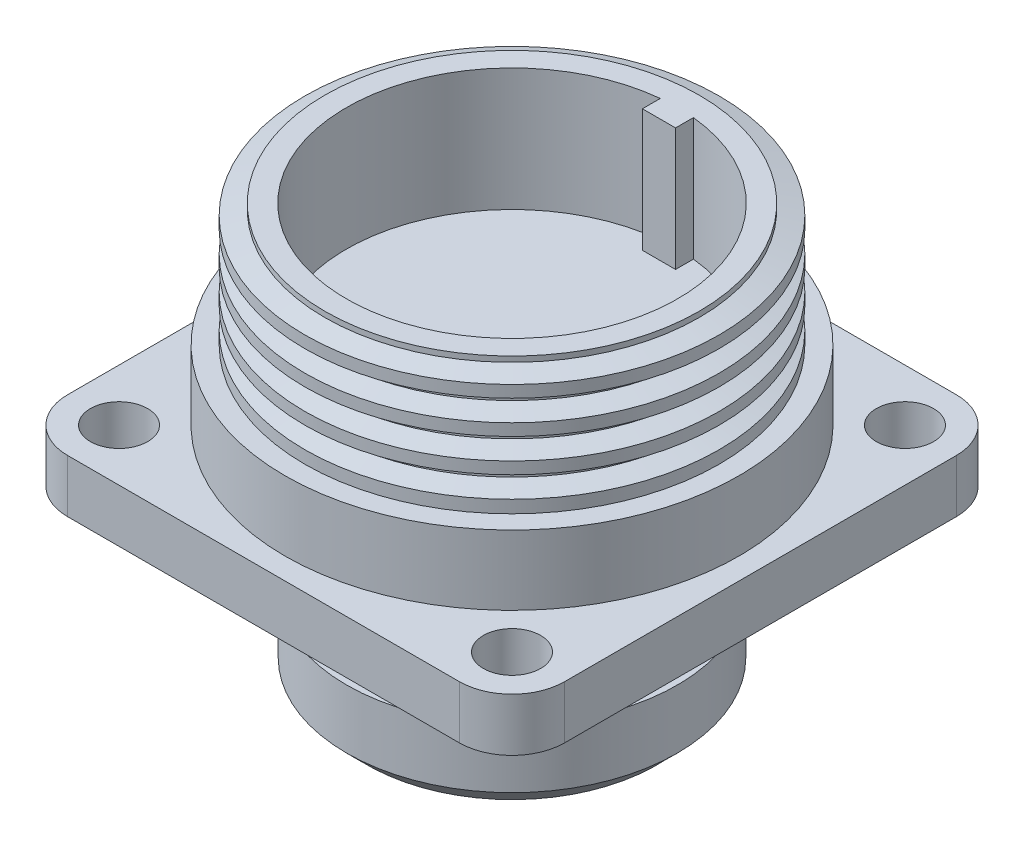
ISO-10303-21;
HEADER;
FILE_DESCRIPTION(('STEP AP214'),'2;1');
FILE_NAME('part.step','',(''),(''),'','','');
FILE_SCHEMA(('AUTOMOTIVE_DESIGN { 1 0 10303 214 1 1 1 1 }'));
ENDSEC;
DATA;
#1=APPLICATION_CONTEXT('core data for automotive mechanical design processes');
#2=APPLICATION_PROTOCOL_DEFINITION('international standard','automotive_design',2000,#1);
#3=PRODUCT_CONTEXT('',#1,'mechanical');
#4=PRODUCT('Part','Part','',(#3));
#5=PRODUCT_RELATED_PRODUCT_CATEGORY('part','',(#4));
#6=PRODUCT_DEFINITION_FORMATION('','',#4);
#7=PRODUCT_DEFINITION_CONTEXT('part definition',#1,'design');
#8=PRODUCT_DEFINITION('design','',#6,#7);
#9=PRODUCT_DEFINITION_SHAPE('','',#8);
#10=(LENGTH_UNIT() NAMED_UNIT(*) SI_UNIT(.MILLI.,.METRE.));
#11=(NAMED_UNIT(*) PLANE_ANGLE_UNIT() SI_UNIT($,.RADIAN.));
#12=(NAMED_UNIT(*) SI_UNIT($,.STERADIAN.) SOLID_ANGLE_UNIT());
#13=UNCERTAINTY_MEASURE_WITH_UNIT(LENGTH_MEASURE(1.E-05),#10,'distance_accuracy_value','');
#14=(GEOMETRIC_REPRESENTATION_CONTEXT(3) GLOBAL_UNCERTAINTY_ASSIGNED_CONTEXT((#13)) GLOBAL_UNIT_ASSIGNED_CONTEXT((#10,
#11,#12)) REPRESENTATION_CONTEXT('',''));
#15=CARTESIAN_POINT('',(0.,0.,0.));
#16=DIRECTION('',(0.,0.,1.));
#17=DIRECTION('',(1.,0.,0.));
#18=AXIS2_PLACEMENT_3D('',#15,#16,#17);
#19=CARTESIAN_POINT('',(0.,18.796,0.));
#20=DIRECTION('',(0.,-1.,0.));
#21=DIRECTION('',(0.,0.,-1.));
#22=AXIS2_PLACEMENT_3D('',#19,#20,#21);
#23=CYLINDRICAL_SURFACE('',#22,15.875);
#24=CARTESIAN_POINT('',(0.,9.398,0.));
#25=DIRECTION('',(0.,1.,0.));
#26=DIRECTION('',(0.,0.,1.));
#27=AXIS2_PLACEMENT_3D('',#24,#25,#26);
#28=CIRCLE('',#27,15.875);
#29=CARTESIAN_POINT('',(0.,9.398,15.875));
#30=VERTEX_POINT('',#29);
#31=EDGE_CURVE('E199',#30,#30,#28,.T.);
#32=ORIENTED_EDGE('',*,*,#31,.T.);
#33=EDGE_LOOP('',(#32));
#34=FACE_BOUND('',#33,.T.);
#35=CARTESIAN_POINT('',(0.,10.3627668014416,0.));
#36=DIRECTION('',(0.,-1.,0.));
#37=DIRECTION('',(0.,0.,-1.));
#38=AXIS2_PLACEMENT_3D('',#35,#36,#37);
#39=CIRCLE('',#38,15.8750000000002);
#40=CARTESIAN_POINT('',(0.,10.3627668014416,-15.8750000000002));
#41=VERTEX_POINT('',#40);
#42=EDGE_CURVE('E368',#41,#41,#39,.T.);
#43=ORIENTED_EDGE('',*,*,#42,.T.);
#44=EDGE_LOOP('',(#43));
#45=FACE_BOUND('',#44,.T.);
#46=ADVANCED_FACE('F38',(#34,#45),#23,.T.);
#47=CARTESIAN_POINT('',(-19.05,0.,19.05));
#48=DIRECTION('',(0.,1.,0.));
#49=DIRECTION('',(0.,0.,1.));
#50=AXIS2_PLACEMENT_3D('',#47,#48,#49);
#51=PLANE('',#50);
#52=CARTESIAN_POINT('',(0.,0.,0.));
#53=DIRECTION('',(0.,-1.,0.));
#54=DIRECTION('',(0.,0.,-1.));
#55=AXIS2_PLACEMENT_3D('',#52,#53,#54);
#56=CIRCLE('',#55,15.9131);
#57=CARTESIAN_POINT('',(0.,0.,-15.9131));
#58=VERTEX_POINT('',#57);
#59=EDGE_CURVE('E350',#58,#58,#56,.T.);
#60=ORIENTED_EDGE('',*,*,#59,.F.);
#61=EDGE_LOOP('',(#60));
#62=FACE_BOUND('',#61,.T.);
#63=CARTESIAN_POINT('',(-15.0622,0.,15.0622));
#64=DIRECTION('',(0.,1.,0.));
#65=DIRECTION('',(0.,0.,-1.));
#66=AXIS2_PLACEMENT_3D('',#63,#64,#65);
#67=CIRCLE('',#66,2.1971);
#68=CARTESIAN_POINT('',(-15.0622,0.,12.8651));
#69=VERTEX_POINT('',#68);
#70=EDGE_CURVE('E209',#69,#69,#67,.T.);
#71=ORIENTED_EDGE('',*,*,#70,.T.);
#72=EDGE_LOOP('',(#71));
#73=FACE_BOUND('',#72,.T.);
#74=CARTESIAN_POINT('',(15.0622,0.,-15.0622));
#75=DIRECTION('',(0.,1.,0.));
#76=DIRECTION('',(0.,0.,-1.));
#77=AXIS2_PLACEMENT_3D('',#74,#75,#76);
#78=CIRCLE('',#77,2.1971);
#79=CARTESIAN_POINT('',(15.0622,0.,-17.2593));
#80=VERTEX_POINT('',#79);
#81=EDGE_CURVE('E225',#80,#80,#78,.T.);
#82=ORIENTED_EDGE('',*,*,#81,.T.);
#83=EDGE_LOOP('',(#82));
#84=FACE_BOUND('',#83,.T.);
#85=DIRECTION('',(-1.,0.,0.));
#86=VECTOR('',#85,1.);
#87=CARTESIAN_POINT('',(-19.05,0.,-19.05));
#88=LINE('',#87,#86);
#89=CARTESIAN_POINT('',(15.0114,0.,-19.05));
#90=VERTEX_POINT('',#89);
#91=CARTESIAN_POINT('',(-15.0114,0.,-19.05));
#92=VERTEX_POINT('',#91);
#93=EDGE_CURVE('E249',#90,#92,#88,.T.);
#94=ORIENTED_EDGE('',*,*,#93,.F.);
#95=CARTESIAN_POINT('',(15.0114,0.,-15.0114));
#96=DIRECTION('',(0.,1.,0.));
#97=DIRECTION('',(0.,0.,1.));
#98=AXIS2_PLACEMENT_3D('',#95,#96,#97);
#99=CIRCLE('',#98,4.0386);
#100=CARTESIAN_POINT('',(19.05,0.,-15.0114));
#101=VERTEX_POINT('',#100);
#102=EDGE_CURVE('E301',#90,#101,#99,.F.);
#103=ORIENTED_EDGE('',*,*,#102,.T.);
#104=DIRECTION('',(0.,0.,-1.));
#105=VECTOR('',#104,1.);
#106=CARTESIAN_POINT('',(19.05,0.,-19.05));
#107=LINE('',#106,#105);
#108=CARTESIAN_POINT('',(19.05,0.,15.0114));
#109=VERTEX_POINT('',#108);
#110=EDGE_CURVE('E267',#109,#101,#107,.T.);
#111=ORIENTED_EDGE('',*,*,#110,.F.);
#112=CARTESIAN_POINT('',(15.0114,0.,15.0114));
#113=DIRECTION('',(0.,1.,0.));
#114=DIRECTION('',(0.,0.,1.));
#115=AXIS2_PLACEMENT_3D('',#112,#113,#114);
#116=CIRCLE('',#115,4.0386);
#117=CARTESIAN_POINT('',(15.0114,0.,19.05));
#118=VERTEX_POINT('',#117);
#119=EDGE_CURVE('E292',#109,#118,#116,.F.);
#120=ORIENTED_EDGE('',*,*,#119,.T.);
#121=DIRECTION('',(1.,0.,0.));
#122=VECTOR('',#121,1.);
#123=CARTESIAN_POINT('',(-19.05,0.,19.05));
#124=LINE('',#123,#122);
#125=CARTESIAN_POINT('',(-15.0114,0.,19.05));
#126=VERTEX_POINT('',#125);
#127=EDGE_CURVE('E264',#126,#118,#124,.T.);
#128=ORIENTED_EDGE('',*,*,#127,.F.);
#129=CARTESIAN_POINT('',(-15.0114,0.,15.0114));
#130=DIRECTION('',(0.,1.,0.));
#131=DIRECTION('',(0.,0.,1.));
#132=AXIS2_PLACEMENT_3D('',#129,#130,#131);
#133=CIRCLE('',#132,4.0386);
#134=CARTESIAN_POINT('',(-19.05,0.,15.0114));
#135=VERTEX_POINT('',#134);
#136=EDGE_CURVE('E295',#126,#135,#133,.F.);
#137=ORIENTED_EDGE('',*,*,#136,.T.);
#138=DIRECTION('',(0.,0.,1.));
#139=VECTOR('',#138,1.);
#140=CARTESIAN_POINT('',(-19.05,0.,-19.05));
#141=LINE('',#140,#139);
#142=CARTESIAN_POINT('',(-19.05,0.,-15.0114));
#143=VERTEX_POINT('',#142);
#144=EDGE_CURVE('E241',#143,#135,#141,.T.);
#145=ORIENTED_EDGE('',*,*,#144,.F.);
#146=CARTESIAN_POINT('',(-15.0114,0.,-15.0114));
#147=DIRECTION('',(0.,1.,0.));
#148=DIRECTION('',(0.,0.,1.));
#149=AXIS2_PLACEMENT_3D('',#146,#147,#148);
#150=CIRCLE('',#149,4.0386);
#151=EDGE_CURVE('E298',#143,#92,#150,.F.);
#152=ORIENTED_EDGE('',*,*,#151,.T.);
#153=EDGE_LOOP('',(#94,#103,#111,#120,#128,#137,#145,#152));
#154=FACE_BOUND('',#153,.T.);
#155=CARTESIAN_POINT('',(-15.0622,0.,-15.0622));
#156=DIRECTION('',(0.,1.,0.));
#157=DIRECTION('',(0.,0.,1.));
#158=AXIS2_PLACEMENT_3D('',#155,#156,#157);
#159=CIRCLE('',#158,2.1971);
#160=CARTESIAN_POINT('',(-15.0622,0.,-12.8651));
#161=VERTEX_POINT('',#160);
#162=EDGE_CURVE('E233',#161,#161,#159,.T.);
#163=ORIENTED_EDGE('',*,*,#162,.T.);
#164=EDGE_LOOP('',(#163));
#165=FACE_BOUND('',#164,.T.);
#166=CARTESIAN_POINT('',(15.0622,0.,15.0622));
#167=DIRECTION('',(0.,1.,0.));
#168=DIRECTION('',(0.,0.,1.));
#169=AXIS2_PLACEMENT_3D('',#166,#167,#168);
#170=CIRCLE('',#169,2.1971);
#171=CARTESIAN_POINT('',(15.0622,0.,17.2593));
#172=VERTEX_POINT('',#171);
#173=EDGE_CURVE('E217',#172,#172,#170,.T.);
#174=ORIENTED_EDGE('',*,*,#173,.T.);
#175=EDGE_LOOP('',(#174));
#176=FACE_BOUND('',#175,.T.);
#177=ADVANCED_FACE('F405',(#62,#73,#84,#154,#165,#176),#51,.F.);
#178=CARTESIAN_POINT('',(0.,9.398,0.));
#179=DIRECTION('',(0.,1.,0.));
#180=DIRECTION('',(0.,0.,1.));
#181=AXIS2_PLACEMENT_3D('',#178,#179,#180);
#182=PLANE('',#181);
#183=CARTESIAN_POINT('',(0.,9.398,0.));
#184=DIRECTION('',(0.,1.,0.));
#185=DIRECTION('',(0.,0.,1.));
#186=AXIS2_PLACEMENT_3D('',#183,#184,#185);
#187=CIRCLE('',#186,17.399);
#188=CARTESIAN_POINT('',(0.,9.398,17.399));
#189=VERTEX_POINT('',#188);
#190=EDGE_CURVE('E205',#189,#189,#187,.T.);
#191=ORIENTED_EDGE('',*,*,#190,.T.);
#192=EDGE_LOOP('',(#191));
#193=FACE_BOUND('',#192,.T.);
#194=ORIENTED_EDGE('',*,*,#31,.F.);
#195=EDGE_LOOP('',(#194));
#196=FACE_BOUND('',#195,.T.);
#197=ADVANCED_FACE('F413',(#193,#196),#182,.T.);
#198=CARTESIAN_POINT('',(-19.05,4.064,19.05));
#199=DIRECTION('',(0.,1.,0.));
#200=DIRECTION('',(0.,0.,1.));
#201=AXIS2_PLACEMENT_3D('',#198,#199,#200);
#202=PLANE('',#201);
#203=CARTESIAN_POINT('',(-15.0622,4.064,15.0622));
#204=DIRECTION('',(0.,1.,0.));
#205=DIRECTION('',(0.,0.,-1.));
#206=AXIS2_PLACEMENT_3D('',#203,#204,#205);
#207=CIRCLE('',#206,2.1971);
#208=CARTESIAN_POINT('',(-15.0622,4.064,12.8651));
#209=VERTEX_POINT('',#208);
#210=EDGE_CURVE('E213',#209,#209,#207,.T.);
#211=ORIENTED_EDGE('',*,*,#210,.F.);
#212=EDGE_LOOP('',(#211));
#213=FACE_BOUND('',#212,.T.);
#214=CARTESIAN_POINT('',(15.0622,4.064,-15.0622));
#215=DIRECTION('',(0.,1.,0.));
#216=DIRECTION('',(0.,0.,-1.));
#217=AXIS2_PLACEMENT_3D('',#214,#215,#216);
#218=CIRCLE('',#217,2.1971);
#219=CARTESIAN_POINT('',(15.0622,4.064,-17.2593));
#220=VERTEX_POINT('',#219);
#221=EDGE_CURVE('E229',#220,#220,#218,.T.);
#222=ORIENTED_EDGE('',*,*,#221,.F.);
#223=EDGE_LOOP('',(#222));
#224=FACE_BOUND('',#223,.T.);
#225=DIRECTION('',(0.,0.,-1.));
#226=VECTOR('',#225,1.);
#227=CARTESIAN_POINT('',(19.05,4.064,-19.05));
#228=LINE('',#227,#226);
#229=CARTESIAN_POINT('',(19.05,4.064,15.0114));
#230=VERTEX_POINT('',#229);
#231=CARTESIAN_POINT('',(19.05,4.064,-15.0114));
#232=VERTEX_POINT('',#231);
#233=EDGE_CURVE('E252',#230,#232,#228,.T.);
#234=ORIENTED_EDGE('',*,*,#233,.T.);
#235=CARTESIAN_POINT('',(15.0114,4.064,-15.0114));
#236=DIRECTION('',(0.,1.,0.));
#237=DIRECTION('',(0.,0.,1.));
#238=AXIS2_PLACEMENT_3D('',#235,#236,#237);
#239=CIRCLE('',#238,4.0386);
#240=CARTESIAN_POINT('',(15.0114,4.064,-19.05));
#241=VERTEX_POINT('',#240);
#242=EDGE_CURVE('E319',#232,#241,#239,.T.);
#243=ORIENTED_EDGE('',*,*,#242,.T.);
#244=DIRECTION('',(-1.,0.,0.));
#245=VECTOR('',#244,1.);
#246=CARTESIAN_POINT('',(-19.05,4.064,-19.05));
#247=LINE('',#246,#245);
#248=CARTESIAN_POINT('',(-15.0114,4.064,-19.05));
#249=VERTEX_POINT('',#248);
#250=EDGE_CURVE('E256',#241,#249,#247,.T.);
#251=ORIENTED_EDGE('',*,*,#250,.T.);
#252=CARTESIAN_POINT('',(-15.0114,4.064,-15.0114));
#253=DIRECTION('',(0.,1.,0.));
#254=DIRECTION('',(0.,0.,1.));
#255=AXIS2_PLACEMENT_3D('',#252,#253,#254);
#256=CIRCLE('',#255,4.0386);
#257=CARTESIAN_POINT('',(-19.05,4.064,-15.0114));
#258=VERTEX_POINT('',#257);
#259=EDGE_CURVE('E316',#249,#258,#256,.T.);
#260=ORIENTED_EDGE('',*,*,#259,.T.);
#261=DIRECTION('',(0.,0.,1.));
#262=VECTOR('',#261,1.);
#263=CARTESIAN_POINT('',(-19.05,4.064,-19.05));
#264=LINE('',#263,#262);
#265=CARTESIAN_POINT('',(-19.05,4.064,15.0114));
#266=VERTEX_POINT('',#265);
#267=EDGE_CURVE('E245',#258,#266,#264,.T.);
#268=ORIENTED_EDGE('',*,*,#267,.T.);
#269=CARTESIAN_POINT('',(-15.0114,4.064,15.0114));
#270=DIRECTION('',(0.,1.,0.));
#271=DIRECTION('',(0.,0.,1.));
#272=AXIS2_PLACEMENT_3D('',#269,#270,#271);
#273=CIRCLE('',#272,4.0386);
#274=CARTESIAN_POINT('',(-15.0114,4.064,19.05));
#275=VERTEX_POINT('',#274);
#276=EDGE_CURVE('E66',#266,#275,#273,.T.);
#277=ORIENTED_EDGE('',*,*,#276,.T.);
#278=DIRECTION('',(1.,0.,0.));
#279=VECTOR('',#278,1.);
#280=CARTESIAN_POINT('',(-19.05,4.064,19.05));
#281=LINE('',#280,#279);
#282=CARTESIAN_POINT('',(15.0114,4.064,19.05));
#283=VERTEX_POINT('',#282);
#284=EDGE_CURVE('E248',#275,#283,#281,.T.);
#285=ORIENTED_EDGE('',*,*,#284,.T.);
#286=CARTESIAN_POINT('',(15.0114,4.064,15.0114));
#287=DIRECTION('',(0.,1.,0.));
#288=DIRECTION('',(0.,0.,1.));
#289=AXIS2_PLACEMENT_3D('',#286,#287,#288);
#290=CIRCLE('',#289,4.0386);
#291=EDGE_CURVE('E311',#283,#230,#290,.T.);
#292=ORIENTED_EDGE('',*,*,#291,.T.);
#293=EDGE_LOOP('',(#234,#243,#251,#260,#268,#277,#285,#292));
#294=FACE_BOUND('',#293,.T.);
#295=CARTESIAN_POINT('',(-15.0622,4.064,-15.0622));
#296=DIRECTION('',(0.,1.,0.));
#297=DIRECTION('',(0.,0.,1.));
#298=AXIS2_PLACEMENT_3D('',#295,#296,#297);
#299=CIRCLE('',#298,2.1971);
#300=CARTESIAN_POINT('',(-15.0622,4.064,-12.8651));
#301=VERTEX_POINT('',#300);
#302=EDGE_CURVE('E237',#301,#301,#299,.T.);
#303=ORIENTED_EDGE('',*,*,#302,.F.);
#304=EDGE_LOOP('',(#303));
#305=FACE_BOUND('',#304,.T.);
#306=CARTESIAN_POINT('',(15.0622,4.064,15.0622));
#307=DIRECTION('',(0.,1.,0.));
#308=DIRECTION('',(0.,0.,1.));
#309=AXIS2_PLACEMENT_3D('',#306,#307,#308);
#310=CIRCLE('',#309,2.1971);
#311=CARTESIAN_POINT('',(15.0622,4.064,17.2593));
#312=VERTEX_POINT('',#311);
#313=EDGE_CURVE('E221',#312,#312,#310,.T.);
#314=ORIENTED_EDGE('',*,*,#313,.F.);
#315=EDGE_LOOP('',(#314));
#316=FACE_BOUND('',#315,.T.);
#317=CARTESIAN_POINT('',(0.,4.064,0.));
#318=DIRECTION('',(0.,1.,0.));
#319=DIRECTION('',(0.,0.,1.));
#320=AXIS2_PLACEMENT_3D('',#317,#318,#319);
#321=CIRCLE('',#320,17.399);
#322=CARTESIAN_POINT('',(0.,4.064,17.399));
#323=VERTEX_POINT('',#322);
#324=EDGE_CURVE('E204',#323,#323,#321,.T.);
#325=ORIENTED_EDGE('',*,*,#324,.F.);
#326=EDGE_LOOP('',(#325));
#327=FACE_BOUND('',#326,.T.);
#328=ADVANCED_FACE('F873',(#213,#224,#294,#305,#316,#327),#202,.T.);
#329=CARTESIAN_POINT('',(-19.05,4.064,-19.05));
#330=DIRECTION('',(1.,0.,0.));
#331=DIRECTION('',(0.,0.,-1.));
#332=AXIS2_PLACEMENT_3D('',#329,#330,#331);
#333=PLANE('',#332);
#334=ORIENTED_EDGE('',*,*,#267,.F.);
#335=DIRECTION('',(0.,-1.,0.));
#336=VECTOR('',#335,1.);
#337=CARTESIAN_POINT('',(-19.05,4.064,-15.0114));
#338=LINE('',#337,#336);
#339=EDGE_CURVE('E325',#258,#143,#338,.T.);
#340=ORIENTED_EDGE('',*,*,#339,.T.);
#341=ORIENTED_EDGE('',*,*,#144,.T.);
#342=DIRECTION('',(0.,-1.,0.));
#343=VECTOR('',#342,1.);
#344=CARTESIAN_POINT('',(-19.05,4.064,15.0114));
#345=LINE('',#344,#343);
#346=EDGE_CURVE('E322',#135,#266,#345,.F.);
#347=ORIENTED_EDGE('',*,*,#346,.T.);
#348=EDGE_LOOP('',(#334,#340,#341,#347));
#349=FACE_BOUND('',#348,.T.);
#350=ADVANCED_FACE('F866',(#349),#333,.F.);
#351=CARTESIAN_POINT('',(-19.05,4.064,19.05));
#352=DIRECTION('',(0.,0.,-1.));
#353=DIRECTION('',(-1.,0.,0.));
#354=AXIS2_PLACEMENT_3D('',#351,#352,#353);
#355=PLANE('',#354);
#356=ORIENTED_EDGE('',*,*,#284,.F.);
#357=DIRECTION('',(0.,-1.,0.));
#358=VECTOR('',#357,1.);
#359=CARTESIAN_POINT('',(-15.0114,4.064,19.05));
#360=LINE('',#359,#358);
#361=EDGE_CURVE('E11',#275,#126,#360,.T.);
#362=ORIENTED_EDGE('',*,*,#361,.T.);
#363=ORIENTED_EDGE('',*,*,#127,.T.);
#364=DIRECTION('',(0.,-1.,0.));
#365=VECTOR('',#364,1.);
#366=CARTESIAN_POINT('',(15.0114,4.064,19.05));
#367=LINE('',#366,#365);
#368=EDGE_CURVE('E48',#118,#283,#367,.F.);
#369=ORIENTED_EDGE('',*,*,#368,.T.);
#370=EDGE_LOOP('',(#356,#362,#363,#369));
#371=FACE_BOUND('',#370,.T.);
#372=ADVANCED_FACE('F858',(#371),#355,.F.);
#373=CARTESIAN_POINT('',(19.05,4.064,-19.05));
#374=DIRECTION('',(-1.,0.,0.));
#375=DIRECTION('',(0.,0.,1.));
#376=AXIS2_PLACEMENT_3D('',#373,#374,#375);
#377=PLANE('',#376);
#378=ORIENTED_EDGE('',*,*,#110,.T.);
#379=DIRECTION('',(0.,-1.,0.));
#380=VECTOR('',#379,1.);
#381=CARTESIAN_POINT('',(19.05,4.064,-15.0114));
#382=LINE('',#381,#380);
#383=EDGE_CURVE('E308',#101,#232,#382,.F.);
#384=ORIENTED_EDGE('',*,*,#383,.T.);
#385=ORIENTED_EDGE('',*,*,#233,.F.);
#386=DIRECTION('',(0.,-1.,0.));
#387=VECTOR('',#386,1.);
#388=CARTESIAN_POINT('',(19.05,4.064,15.0114));
#389=LINE('',#388,#387);
#390=EDGE_CURVE('E304',#230,#109,#389,.T.);
#391=ORIENTED_EDGE('',*,*,#390,.T.);
#392=EDGE_LOOP('',(#378,#384,#385,#391));
#393=FACE_BOUND('',#392,.T.);
#394=ADVANCED_FACE('F850',(#393),#377,.F.);
#395=CARTESIAN_POINT('',(-19.05,4.064,-19.05));
#396=DIRECTION('',(0.,0.,1.));
#397=DIRECTION('',(1.,0.,0.));
#398=AXIS2_PLACEMENT_3D('',#395,#396,#397);
#399=PLANE('',#398);
#400=ORIENTED_EDGE('',*,*,#250,.F.);
#401=DIRECTION('',(0.,-1.,0.));
#402=VECTOR('',#401,1.);
#403=CARTESIAN_POINT('',(15.0114,4.064,-19.05));
#404=LINE('',#403,#402);
#405=EDGE_CURVE('E288',#241,#90,#404,.T.);
#406=ORIENTED_EDGE('',*,*,#405,.T.);
#407=ORIENTED_EDGE('',*,*,#93,.T.);
#408=DIRECTION('',(0.,-1.,0.));
#409=VECTOR('',#408,1.);
#410=CARTESIAN_POINT('',(-15.0114,4.064,-19.05));
#411=LINE('',#410,#409);
#412=EDGE_CURVE('E285',#92,#249,#411,.F.);
#413=ORIENTED_EDGE('',*,*,#412,.T.);
#414=EDGE_LOOP('',(#400,#406,#407,#413));
#415=FACE_BOUND('',#414,.T.);
#416=ADVANCED_FACE('F843',(#415),#399,.F.);
#417=CARTESIAN_POINT('',(-15.0622,4.064,-15.0622));
#418=DIRECTION('',(0.,-1.,0.));
#419=DIRECTION('',(0.,0.,-1.));
#420=AXIS2_PLACEMENT_3D('',#417,#418,#419);
#421=CYLINDRICAL_SURFACE('',#420,2.1971);
#422=ORIENTED_EDGE('',*,*,#302,.T.);
#423=EDGE_LOOP('',(#422));
#424=FACE_BOUND('',#423,.T.);
#425=ORIENTED_EDGE('',*,*,#162,.F.);
#426=EDGE_LOOP('',(#425));
#427=FACE_BOUND('',#426,.T.);
#428=ADVANCED_FACE('F835',(#424,#427),#421,.F.);
#429=CARTESIAN_POINT('',(15.0622,4.064,-15.0622));
#430=DIRECTION('',(0.,-1.,0.));
#431=DIRECTION('',(0.,0.,-1.));
#432=AXIS2_PLACEMENT_3D('',#429,#430,#431);
#433=CYLINDRICAL_SURFACE('',#432,2.1971);
#434=ORIENTED_EDGE('',*,*,#221,.T.);
#435=EDGE_LOOP('',(#434));
#436=FACE_BOUND('',#435,.T.);
#437=ORIENTED_EDGE('',*,*,#81,.F.);
#438=EDGE_LOOP('',(#437));
#439=FACE_BOUND('',#438,.T.);
#440=ADVANCED_FACE('F827',(#436,#439),#433,.F.);
#441=CARTESIAN_POINT('',(15.0622,4.064,15.0622));
#442=DIRECTION('',(0.,-1.,0.));
#443=DIRECTION('',(0.,0.,-1.));
#444=AXIS2_PLACEMENT_3D('',#441,#442,#443);
#445=CYLINDRICAL_SURFACE('',#444,2.1971);
#446=ORIENTED_EDGE('',*,*,#313,.T.);
#447=EDGE_LOOP('',(#446));
#448=FACE_BOUND('',#447,.T.);
#449=ORIENTED_EDGE('',*,*,#173,.F.);
#450=EDGE_LOOP('',(#449));
#451=FACE_BOUND('',#450,.T.);
#452=ADVANCED_FACE('F819',(#448,#451),#445,.F.);
#453=CARTESIAN_POINT('',(-15.0622,4.064,15.0622));
#454=DIRECTION('',(0.,-1.,0.));
#455=DIRECTION('',(0.,0.,-1.));
#456=AXIS2_PLACEMENT_3D('',#453,#454,#455);
#457=CYLINDRICAL_SURFACE('',#456,2.1971);
#458=ORIENTED_EDGE('',*,*,#210,.T.);
#459=EDGE_LOOP('',(#458));
#460=FACE_BOUND('',#459,.T.);
#461=ORIENTED_EDGE('',*,*,#70,.F.);
#462=EDGE_LOOP('',(#461));
#463=FACE_BOUND('',#462,.T.);
#464=ADVANCED_FACE('F794',(#460,#463),#457,.F.);
#465=CARTESIAN_POINT('',(0.,9.398,0.));
#466=DIRECTION('',(0.,-1.,0.));
#467=DIRECTION('',(0.,0.,-1.));
#468=AXIS2_PLACEMENT_3D('',#465,#466,#467);
#469=CYLINDRICAL_SURFACE('',#468,17.399);
#470=ORIENTED_EDGE('',*,*,#190,.F.);
#471=EDGE_LOOP('',(#470));
#472=FACE_BOUND('',#471,.T.);
#473=ORIENTED_EDGE('',*,*,#324,.T.);
#474=EDGE_LOOP('',(#473));
#475=FACE_BOUND('',#474,.T.);
#476=ADVANCED_FACE('F617',(#472,#475),#469,.T.);
#477=CARTESIAN_POINT('',(15.0114,4.064,-15.0114));
#478=DIRECTION('',(0.,-1.,0.));
#479=DIRECTION('',(0.,0.,-1.));
#480=AXIS2_PLACEMENT_3D('',#477,#478,#479);
#481=CYLINDRICAL_SURFACE('',#480,4.0386);
#482=ORIENTED_EDGE('',*,*,#242,.F.);
#483=ORIENTED_EDGE('',*,*,#383,.F.);
#484=ORIENTED_EDGE('',*,*,#102,.F.);
#485=ORIENTED_EDGE('',*,*,#405,.F.);
#486=EDGE_LOOP('',(#482,#483,#484,#485));
#487=FACE_BOUND('',#486,.T.);
#488=ADVANCED_FACE('F610',(#487),#481,.T.);
#489=CARTESIAN_POINT('',(-15.0114,4.064,-15.0114));
#490=DIRECTION('',(0.,-1.,0.));
#491=DIRECTION('',(0.,0.,-1.));
#492=AXIS2_PLACEMENT_3D('',#489,#490,#491);
#493=CYLINDRICAL_SURFACE('',#492,4.0386);
#494=ORIENTED_EDGE('',*,*,#259,.F.);
#495=ORIENTED_EDGE('',*,*,#412,.F.);
#496=ORIENTED_EDGE('',*,*,#151,.F.);
#497=ORIENTED_EDGE('',*,*,#339,.F.);
#498=EDGE_LOOP('',(#494,#495,#496,#497));
#499=FACE_BOUND('',#498,.T.);
#500=ADVANCED_FACE('F616',(#499),#493,.T.);
#501=CARTESIAN_POINT('',(-15.0114,4.064,15.0114));
#502=DIRECTION('',(0.,-1.,0.));
#503=DIRECTION('',(0.,0.,-1.));
#504=AXIS2_PLACEMENT_3D('',#501,#502,#503);
#505=CYLINDRICAL_SURFACE('',#504,4.0386);
#506=ORIENTED_EDGE('',*,*,#276,.F.);
#507=ORIENTED_EDGE('',*,*,#346,.F.);
#508=ORIENTED_EDGE('',*,*,#136,.F.);
#509=ORIENTED_EDGE('',*,*,#361,.F.);
#510=EDGE_LOOP('',(#506,#507,#508,#509));
#511=FACE_BOUND('',#510,.T.);
#512=ADVANCED_FACE('F627',(#511),#505,.T.);
#513=CARTESIAN_POINT('',(15.0114,4.064,15.0114));
#514=DIRECTION('',(0.,-1.,0.));
#515=DIRECTION('',(0.,0.,-1.));
#516=AXIS2_PLACEMENT_3D('',#513,#514,#515);
#517=CYLINDRICAL_SURFACE('',#516,4.0386);
#518=ORIENTED_EDGE('',*,*,#291,.F.);
#519=ORIENTED_EDGE('',*,*,#368,.F.);
#520=ORIENTED_EDGE('',*,*,#119,.F.);
#521=ORIENTED_EDGE('',*,*,#390,.F.);
#522=EDGE_LOOP('',(#518,#519,#520,#521));
#523=FACE_BOUND('',#522,.T.);
#524=ADVANCED_FACE('F40',(#523),#517,.T.);
#525=CARTESIAN_POINT('',(0.,0.,0.));
#526=DIRECTION('',(0.,-1.,0.));
#527=DIRECTION('',(0.,0.,-1.));
#528=AXIS2_PLACEMENT_3D('',#525,#526,#527);
#529=CYLINDRICAL_SURFACE('',#528,13.3477);
#530=CARTESIAN_POINT('',(0.,0.,0.));
#531=DIRECTION('',(0.,-1.,0.));
#532=DIRECTION('',(0.,0.,-1.));
#533=AXIS2_PLACEMENT_3D('',#530,#531,#532);
#534=CIRCLE('',#533,13.3477);
#535=CARTESIAN_POINT('',(0.,0.,-13.3477));
#536=VERTEX_POINT('',#535);
#537=EDGE_CURVE('E348',#536,#536,#534,.T.);
#538=ORIENTED_EDGE('',*,*,#537,.F.);
#539=EDGE_LOOP('',(#538));
#540=FACE_BOUND('',#539,.T.);
#541=CARTESIAN_POINT('',(0.,1.27,0.));
#542=DIRECTION('',(0.,-1.,0.));
#543=DIRECTION('',(0.,0.,-1.));
#544=AXIS2_PLACEMENT_3D('',#541,#542,#543);
#545=CIRCLE('',#544,13.3477);
#546=CARTESIAN_POINT('',(0.,1.27,-13.3477));
#547=VERTEX_POINT('',#546);
#548=EDGE_CURVE('E343',#547,#547,#545,.T.);
#549=ORIENTED_EDGE('',*,*,#548,.T.);
#550=EDGE_LOOP('',(#549));
#551=FACE_BOUND('',#550,.T.);
#552=ADVANCED_FACE('F643',(#540,#551),#529,.T.);
#553=CARTESIAN_POINT('',(0.,1.27,-13.3477));
#554=DIRECTION('',(0.,1.,0.));
#555=DIRECTION('',(0.,0.,1.));
#556=AXIS2_PLACEMENT_3D('',#553,#554,#555);
#557=PLANE('',#556);
#558=ORIENTED_EDGE('',*,*,#548,.F.);
#559=EDGE_LOOP('',(#558));
#560=FACE_BOUND('',#559,.T.);
#561=CARTESIAN_POINT('',(0.,1.27,0.));
#562=DIRECTION('',(0.,-1.,0.));
#563=DIRECTION('',(0.,0.,-1.));
#564=AXIS2_PLACEMENT_3D('',#561,#562,#563);
#565=CIRCLE('',#564,15.9131);
#566=CARTESIAN_POINT('',(0.,1.27,-15.9131));
#567=VERTEX_POINT('',#566);
#568=EDGE_CURVE('E355',#567,#567,#565,.T.);
#569=ORIENTED_EDGE('',*,*,#568,.T.);
#570=EDGE_LOOP('',(#569));
#571=FACE_BOUND('',#570,.T.);
#572=ADVANCED_FACE('F700',(#560,#571),#557,.F.);
#573=CARTESIAN_POINT('',(0.,0.,0.));
#574=DIRECTION('',(0.,-1.,0.));
#575=DIRECTION('',(0.,0.,-1.));
#576=AXIS2_PLACEMENT_3D('',#573,#574,#575);
#577=CYLINDRICAL_SURFACE('',#576,15.9131);
#578=ORIENTED_EDGE('',*,*,#568,.F.);
#579=EDGE_LOOP('',(#578));
#580=FACE_BOUND('',#579,.T.);
#581=ORIENTED_EDGE('',*,*,#59,.T.);
#582=EDGE_LOOP('',(#581));
#583=FACE_BOUND('',#582,.T.);
#584=ADVANCED_FACE('F512',(#580,#583),#577,.F.);
#585=CARTESIAN_POINT('',(0.,-12.954,0.));
#586=DIRECTION('',(0.,-1.,0.));
#587=DIRECTION('',(0.,0.,-1.));
#588=AXIS2_PLACEMENT_3D('',#585,#586,#587);
#589=PLANE('',#588);
#590=CARTESIAN_POINT('',(0.,-12.954,0.));
#591=DIRECTION('',(0.,-1.,0.));
#592=DIRECTION('',(0.,0.,-1.));
#593=AXIS2_PLACEMENT_3D('',#590,#591,#592);
#594=CIRCLE('',#593,11.0998);
#595=CARTESIAN_POINT('',(0.,-12.954,-11.0998));
#596=VERTEX_POINT('',#595);
#597=EDGE_CURVE('E277',#596,#596,#594,.T.);
#598=ORIENTED_EDGE('',*,*,#597,.T.);
#599=EDGE_LOOP('',(#598));
#600=FACE_BOUND('',#599,.T.);
#601=ADVANCED_FACE('F510',(#600),#589,.T.);
#602=CARTESIAN_POINT('',(0.,-12.954,0.));
#603=DIRECTION('',(0.,1.,0.));
#604=DIRECTION('',(0.,0.,1.));
#605=AXIS2_PLACEMENT_3D('',#602,#603,#604);
#606=CONICAL_SURFACE('',#605,11.0998,0.785398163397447);
#607=CARTESIAN_POINT('',(0.,-11.3792,0.));
#608=DIRECTION('',(0.,-1.,0.));
#609=DIRECTION('',(0.,0.,-1.));
#610=AXIS2_PLACEMENT_3D('',#607,#608,#609);
#611=CIRCLE('',#610,12.6746);
#612=CARTESIAN_POINT('',(0.,-11.3792,-12.6746));
#613=VERTEX_POINT('',#612);
#614=EDGE_CURVE('E281',#613,#613,#611,.F.);
#615=ORIENTED_EDGE('',*,*,#614,.F.);
#616=EDGE_LOOP('',(#615));
#617=FACE_BOUND('',#616,.T.);
#618=ORIENTED_EDGE('',*,*,#597,.F.);
#619=EDGE_LOOP('',(#618));
#620=FACE_BOUND('',#619,.T.);
#621=ADVANCED_FACE('F507',(#617,#620),#606,.T.);
#622=CARTESIAN_POINT('',(0.,-12.954,0.));
#623=DIRECTION('',(0.,1.,0.));
#624=DIRECTION('',(0.,0.,1.));
#625=AXIS2_PLACEMENT_3D('',#622,#623,#624);
#626=CYLINDRICAL_SURFACE('',#625,12.6746);
#627=ORIENTED_EDGE('',*,*,#614,.T.);
#628=EDGE_LOOP('',(#627));
#629=FACE_BOUND('',#628,.T.);
#630=CARTESIAN_POINT('',(0.,-6.858,0.));
#631=DIRECTION('',(0.,1.,0.));
#632=DIRECTION('',(0.,0.,1.));
#633=AXIS2_PLACEMENT_3D('',#630,#631,#632);
#634=CIRCLE('',#633,12.6746);
#635=CARTESIAN_POINT('',(0.,-6.858,12.6746));
#636=VERTEX_POINT('',#635);
#637=EDGE_CURVE('E331',#636,#636,#634,.T.);
#638=ORIENTED_EDGE('',*,*,#637,.F.);
#639=EDGE_LOOP('',(#638));
#640=FACE_BOUND('',#639,.T.);
#641=ADVANCED_FACE('F503',(#629,#640),#626,.T.);
#642=CARTESIAN_POINT('',(0.,-6.858,-12.6746));
#643=DIRECTION('',(0.,1.,0.));
#644=DIRECTION('',(0.,0.,1.));
#645=AXIS2_PLACEMENT_3D('',#642,#643,#644);
#646=PLANE('',#645);
#647=ORIENTED_EDGE('',*,*,#637,.T.);
#648=EDGE_LOOP('',(#647));
#649=FACE_BOUND('',#648,.T.);
#650=CARTESIAN_POINT('',(0.,-6.858,0.));
#651=DIRECTION('',(0.,1.,0.));
#652=DIRECTION('',(0.,0.,1.));
#653=AXIS2_PLACEMENT_3D('',#650,#651,#652);
#654=CIRCLE('',#653,11.43);
#655=CARTESIAN_POINT('',(0.,-6.858,11.43));
#656=VERTEX_POINT('',#655);
#657=EDGE_CURVE('E334',#656,#656,#654,.T.);
#658=ORIENTED_EDGE('',*,*,#657,.F.);
#659=EDGE_LOOP('',(#658));
#660=FACE_BOUND('',#659,.T.);
#661=ADVANCED_FACE('F506',(#649,#660),#646,.T.);
#662=CARTESIAN_POINT('',(0.,0.,0.));
#663=DIRECTION('',(0.,1.,0.));
#664=DIRECTION('',(0.,0.,1.));
#665=AXIS2_PLACEMENT_3D('',#662,#663,#664);
#666=CYLINDRICAL_SURFACE('',#665,11.43);
#667=ORIENTED_EDGE('',*,*,#657,.T.);
#668=EDGE_LOOP('',(#667));
#669=FACE_BOUND('',#668,.T.);
#670=CARTESIAN_POINT('',(0.,-4.4958,0.));
#671=DIRECTION('',(0.,1.,0.));
#672=DIRECTION('',(0.,0.,1.));
#673=AXIS2_PLACEMENT_3D('',#670,#671,#672);
#674=CIRCLE('',#673,11.43);
#675=CARTESIAN_POINT('',(0.,-4.4958,11.43));
#676=VERTEX_POINT('',#675);
#677=EDGE_CURVE('E338',#676,#676,#674,.T.);
#678=ORIENTED_EDGE('',*,*,#677,.F.);
#679=EDGE_LOOP('',(#678));
#680=FACE_BOUND('',#679,.T.);
#681=ADVANCED_FACE('F666',(#669,#680),#666,.T.);
#682=CARTESIAN_POINT('',(0.,-4.4958,-12.6746));
#683=DIRECTION('',(0.,-1.,0.));
#684=DIRECTION('',(0.,0.,-1.));
#685=AXIS2_PLACEMENT_3D('',#682,#683,#684);
#686=PLANE('',#685);
#687=ORIENTED_EDGE('',*,*,#677,.T.);
#688=EDGE_LOOP('',(#687));
#689=FACE_BOUND('',#688,.T.);
#690=CARTESIAN_POINT('',(0.,-4.4958,0.));
#691=DIRECTION('',(0.,1.,0.));
#692=DIRECTION('',(0.,0.,1.));
#693=AXIS2_PLACEMENT_3D('',#690,#691,#692);
#694=CIRCLE('',#693,12.6746);
#695=CARTESIAN_POINT('',(0.,-4.4958,12.6746));
#696=VERTEX_POINT('',#695);
#697=EDGE_CURVE('E340',#696,#696,#694,.T.);
#698=ORIENTED_EDGE('',*,*,#697,.F.);
#699=EDGE_LOOP('',(#698));
#700=FACE_BOUND('',#699,.T.);
#701=ADVANCED_FACE('F651',(#689,#700),#686,.T.);
#702=CARTESIAN_POINT('',(0.,0.,0.));
#703=DIRECTION('',(0.,1.,0.));
#704=DIRECTION('',(0.,0.,1.));
#705=AXIS2_PLACEMENT_3D('',#702,#703,#704);
#706=CIRCLE('',#705,12.6746);
#707=CARTESIAN_POINT('',(0.,0.,12.6746));
#708=VERTEX_POINT('',#707);
#709=EDGE_CURVE('E260',#708,#708,#706,.F.);
#710=ORIENTED_EDGE('',*,*,#709,.T.);
#711=EDGE_LOOP('',(#710));
#712=FACE_BOUND('',#711,.T.);
#713=ORIENTED_EDGE('',*,*,#697,.T.);
#714=EDGE_LOOP('',(#713));
#715=FACE_BOUND('',#714,.T.);
#716=ADVANCED_FACE('F509',(#712,#715),#626,.T.);
#717=ORIENTED_EDGE('',*,*,#537,.T.);
#718=EDGE_LOOP('',(#717));
#719=FACE_BOUND('',#718,.T.);
#720=ORIENTED_EDGE('',*,*,#709,.F.);
#721=EDGE_LOOP('',(#720));
#722=FACE_BOUND('',#721,.T.);
#723=ADVANCED_FACE('F416',(#719,#722),#51,.F.);
#724=CARTESIAN_POINT('',(0.,10.7569,0.));
#725=DIRECTION('',(0.,-1.,0.));
#726=DIRECTION('',(0.,0.,-1.));
#727=AXIS2_PLACEMENT_3D('',#724,#725,#726);
#728=CONICAL_SURFACE('',#727,14.3510000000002,1.31772358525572);
#729=ORIENTED_EDGE('',*,*,#42,.F.);
#730=EDGE_LOOP('',(#729));
#731=FACE_BOUND('',#730,.T.);
#732=CARTESIAN_POINT('',(0.,10.7569,0.));
#733=DIRECTION('',(0.,-1.,0.));
#734=DIRECTION('',(0.,0.,-1.));
#735=AXIS2_PLACEMENT_3D('',#732,#733,#734);
#736=CIRCLE('',#735,14.3510000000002);
#737=CARTESIAN_POINT('',(0.,10.7569,-14.3510000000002));
#738=VERTEX_POINT('',#737);
#739=EDGE_CURVE('E372',#738,#738,#736,.T.);
#740=ORIENTED_EDGE('',*,*,#739,.T.);
#741=EDGE_LOOP('',(#740));
#742=FACE_BOUND('',#741,.T.);
#743=ADVANCED_FACE('F691',(#731,#742),#728,.T.);
#744=CARTESIAN_POINT('',(0.,0.,0.));
#745=DIRECTION('',(0.,-1.,0.));
#746=DIRECTION('',(0.,0.,-1.));
#747=AXIS2_PLACEMENT_3D('',#744,#745,#746);
#748=CYLINDRICAL_SURFACE('',#747,14.3510000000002);
#749=ORIENTED_EDGE('',*,*,#739,.F.);
#750=EDGE_LOOP('',(#749));
#751=FACE_BOUND('',#750,.T.);
#752=CARTESIAN_POINT('',(0.,11.5951,0.));
#753=DIRECTION('',(0.,-1.,0.));
#754=DIRECTION('',(0.,0.,-1.));
#755=AXIS2_PLACEMENT_3D('',#752,#753,#754);
#756=CIRCLE('',#755,14.3510000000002);
#757=CARTESIAN_POINT('',(0.,11.5951,-14.3510000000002));
#758=VERTEX_POINT('',#757);
#759=EDGE_CURVE('E375',#758,#758,#756,.T.);
#760=ORIENTED_EDGE('',*,*,#759,.T.);
#761=EDGE_LOOP('',(#760));
#762=FACE_BOUND('',#761,.T.);
#763=ADVANCED_FACE('F740',(#751,#762),#748,.T.);
#764=CARTESIAN_POINT('',(0.,11.9892331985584,0.));
#765=DIRECTION('',(0.,1.,0.));
#766=DIRECTION('',(0.,0.,1.));
#767=AXIS2_PLACEMENT_3D('',#764,#765,#766);
#768=CONICAL_SURFACE('',#767,15.8750000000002,1.31772358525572);
#769=ORIENTED_EDGE('',*,*,#759,.F.);
#770=EDGE_LOOP('',(#769));
#771=FACE_BOUND('',#770,.T.);
#772=CARTESIAN_POINT('',(0.,11.9892331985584,0.));
#773=DIRECTION('',(0.,-1.,0.));
#774=DIRECTION('',(0.,0.,-1.));
#775=AXIS2_PLACEMENT_3D('',#772,#773,#774);
#776=CIRCLE('',#775,15.8750000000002);
#777=CARTESIAN_POINT('',(0.,11.9892331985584,-15.8750000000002));
#778=VERTEX_POINT('',#777);
#779=EDGE_CURVE('E481',#778,#778,#776,.T.);
#780=ORIENTED_EDGE('',*,*,#779,.T.);
#781=EDGE_LOOP('',(#780));
#782=FACE_BOUND('',#781,.T.);
#783=ADVANCED_FACE('F422',(#771,#782),#768,.T.);
#784=ORIENTED_EDGE('',*,*,#779,.F.);
#785=EDGE_LOOP('',(#784));
#786=FACE_BOUND('',#785,.T.);
#787=CARTESIAN_POINT('',(0.,12.9027668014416,0.));
#788=DIRECTION('',(0.,-1.,0.));
#789=DIRECTION('',(0.,0.,-1.));
#790=AXIS2_PLACEMENT_3D('',#787,#788,#789);
#791=CIRCLE('',#790,15.8750000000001);
#792=CARTESIAN_POINT('',(0.,12.9027668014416,-15.8750000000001));
#793=VERTEX_POINT('',#792);
#794=EDGE_CURVE('E477',#793,#793,#791,.T.);
#795=ORIENTED_EDGE('',*,*,#794,.T.);
#796=EDGE_LOOP('',(#795));
#797=FACE_BOUND('',#796,.T.);
#798=ADVANCED_FACE('F408',(#786,#797),#23,.T.);
#799=CARTESIAN_POINT('',(0.,13.2969,0.));
#800=DIRECTION('',(0.,-1.,0.));
#801=DIRECTION('',(0.,0.,-1.));
#802=AXIS2_PLACEMENT_3D('',#799,#800,#801);
#803=CONICAL_SURFACE('',#802,14.3510000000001,1.31772358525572);
#804=ORIENTED_EDGE('',*,*,#794,.F.);
#805=EDGE_LOOP('',(#804));
#806=FACE_BOUND('',#805,.T.);
#807=CARTESIAN_POINT('',(0.,13.2969,0.));
#808=DIRECTION('',(0.,-1.,0.));
#809=DIRECTION('',(0.,0.,-1.));
#810=AXIS2_PLACEMENT_3D('',#807,#808,#809);
#811=CIRCLE('',#810,14.3510000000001);
#812=CARTESIAN_POINT('',(0.,13.2969,-14.3510000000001));
#813=VERTEX_POINT('',#812);
#814=EDGE_CURVE('E473',#813,#813,#811,.T.);
#815=ORIENTED_EDGE('',*,*,#814,.T.);
#816=EDGE_LOOP('',(#815));
#817=FACE_BOUND('',#816,.T.);
#818=ADVANCED_FACE('F421',(#806,#817),#803,.T.);
#819=CARTESIAN_POINT('',(0.,0.,0.));
#820=DIRECTION('',(0.,-1.,0.));
#821=DIRECTION('',(0.,0.,-1.));
#822=AXIS2_PLACEMENT_3D('',#819,#820,#821);
#823=CYLINDRICAL_SURFACE('',#822,14.3510000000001);
#824=ORIENTED_EDGE('',*,*,#814,.F.);
#825=EDGE_LOOP('',(#824));
#826=FACE_BOUND('',#825,.T.);
#827=CARTESIAN_POINT('',(0.,14.1351,0.));
#828=DIRECTION('',(0.,-1.,0.));
#829=DIRECTION('',(0.,0.,-1.));
#830=AXIS2_PLACEMENT_3D('',#827,#828,#829);
#831=CIRCLE('',#830,14.3510000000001);
#832=CARTESIAN_POINT('',(0.,14.1351,-14.3510000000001));
#833=VERTEX_POINT('',#832);
#834=EDGE_CURVE('E462',#833,#833,#831,.T.);
#835=ORIENTED_EDGE('',*,*,#834,.T.);
#836=EDGE_LOOP('',(#835));
#837=FACE_BOUND('',#836,.T.);
#838=ADVANCED_FACE('F449',(#826,#837),#823,.T.);
#839=CARTESIAN_POINT('',(0.,14.5292331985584,0.));
#840=DIRECTION('',(0.,1.,0.));
#841=DIRECTION('',(0.,0.,1.));
#842=AXIS2_PLACEMENT_3D('',#839,#840,#841);
#843=CONICAL_SURFACE('',#842,15.8750000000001,1.31772358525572);
#844=ORIENTED_EDGE('',*,*,#834,.F.);
#845=EDGE_LOOP('',(#844));
#846=FACE_BOUND('',#845,.T.);
#847=CARTESIAN_POINT('',(0.,14.5292331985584,0.));
#848=DIRECTION('',(0.,-1.,0.));
#849=DIRECTION('',(0.,0.,-1.));
#850=AXIS2_PLACEMENT_3D('',#847,#848,#849);
#851=CIRCLE('',#850,15.8750000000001);
#852=CARTESIAN_POINT('',(0.,14.5292331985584,-15.8750000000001));
#853=VERTEX_POINT('',#852);
#854=EDGE_CURVE('E455',#853,#853,#851,.T.);
#855=ORIENTED_EDGE('',*,*,#854,.T.);
#856=EDGE_LOOP('',(#855));
#857=FACE_BOUND('',#856,.T.);
#858=ADVANCED_FACE('F441',(#846,#857),#843,.T.);
#859=ORIENTED_EDGE('',*,*,#854,.F.);
#860=EDGE_LOOP('',(#859));
#861=FACE_BOUND('',#860,.T.);
#862=CARTESIAN_POINT('',(0.,15.4427668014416,0.));
#863=DIRECTION('',(0.,-1.,0.));
#864=DIRECTION('',(0.,0.,-1.));
#865=AXIS2_PLACEMENT_3D('',#862,#863,#864);
#866=CIRCLE('',#865,15.8750000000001);
#867=CARTESIAN_POINT('',(0.,15.4427668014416,-15.8750000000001));
#868=VERTEX_POINT('',#867);
#869=EDGE_CURVE('E458',#868,#868,#866,.T.);
#870=ORIENTED_EDGE('',*,*,#869,.T.);
#871=EDGE_LOOP('',(#870));
#872=FACE_BOUND('',#871,.T.);
#873=ADVANCED_FACE('F424',(#861,#872),#23,.T.);
#874=CARTESIAN_POINT('',(0.,15.8369,0.));
#875=DIRECTION('',(0.,-1.,0.));
#876=DIRECTION('',(0.,0.,-1.));
#877=AXIS2_PLACEMENT_3D('',#874,#875,#876);
#878=CONICAL_SURFACE('',#877,14.3510000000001,1.31772358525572);
#879=ORIENTED_EDGE('',*,*,#869,.F.);
#880=EDGE_LOOP('',(#879));
#881=FACE_BOUND('',#880,.T.);
#882=CARTESIAN_POINT('',(0.,15.8369,0.));
#883=DIRECTION('',(0.,-1.,0.));
#884=DIRECTION('',(0.,0.,-1.));
#885=AXIS2_PLACEMENT_3D('',#882,#883,#884);
#886=CIRCLE('',#885,14.3510000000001);
#887=CARTESIAN_POINT('',(0.,15.8369,-14.3510000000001));
#888=VERTEX_POINT('',#887);
#889=EDGE_CURVE('E459',#888,#888,#886,.T.);
#890=ORIENTED_EDGE('',*,*,#889,.T.);
#891=EDGE_LOOP('',(#890));
#892=FACE_BOUND('',#891,.T.);
#893=ADVANCED_FACE('F440',(#881,#892),#878,.T.);
#894=CARTESIAN_POINT('',(0.,0.,0.));
#895=DIRECTION('',(0.,-1.,0.));
#896=DIRECTION('',(0.,0.,-1.));
#897=AXIS2_PLACEMENT_3D('',#894,#895,#896);
#898=CYLINDRICAL_SURFACE('',#897,14.3510000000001);
#899=ORIENTED_EDGE('',*,*,#889,.F.);
#900=EDGE_LOOP('',(#899));
#901=FACE_BOUND('',#900,.T.);
#902=CARTESIAN_POINT('',(0.,16.6751,0.));
#903=DIRECTION('',(0.,-1.,0.));
#904=DIRECTION('',(0.,0.,-1.));
#905=AXIS2_PLACEMENT_3D('',#902,#903,#904);
#906=CIRCLE('',#905,14.3510000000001);
#907=CARTESIAN_POINT('',(0.,16.6751,-14.3510000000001));
#908=VERTEX_POINT('',#907);
#909=EDGE_CURVE('E466',#908,#908,#906,.T.);
#910=ORIENTED_EDGE('',*,*,#909,.T.);
#911=EDGE_LOOP('',(#910));
#912=FACE_BOUND('',#911,.T.);
#913=ADVANCED_FACE('F434',(#901,#912),#898,.T.);
#914=CARTESIAN_POINT('',(0.,17.0692331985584,0.));
#915=DIRECTION('',(0.,1.,0.));
#916=DIRECTION('',(0.,0.,1.));
#917=AXIS2_PLACEMENT_3D('',#914,#915,#916);
#918=CONICAL_SURFACE('',#917,15.8750000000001,1.31772358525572);
#919=ORIENTED_EDGE('',*,*,#909,.F.);
#920=EDGE_LOOP('',(#919));
#921=FACE_BOUND('',#920,.T.);
#922=CARTESIAN_POINT('',(0.,17.0692331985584,0.));
#923=DIRECTION('',(0.,-1.,0.));
#924=DIRECTION('',(0.,0.,-1.));
#925=AXIS2_PLACEMENT_3D('',#922,#923,#924);
#926=CIRCLE('',#925,15.8750000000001);
#927=CARTESIAN_POINT('',(0.,17.0692331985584,-15.8750000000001));
#928=VERTEX_POINT('',#927);
#929=EDGE_CURVE('E999',#928,#928,#926,.T.);
#930=ORIENTED_EDGE('',*,*,#929,.T.);
#931=EDGE_LOOP('',(#930));
#932=FACE_BOUND('',#931,.T.);
#933=ADVANCED_FACE('F426',(#921,#932),#918,.T.);
#934=CARTESIAN_POINT('',(0.,17.9827668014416,0.));
#935=DIRECTION('',(0.,-1.,0.));
#936=DIRECTION('',(0.,0.,-1.));
#937=AXIS2_PLACEMENT_3D('',#934,#935,#936);
#938=CIRCLE('',#937,15.875);
#939=CARTESIAN_POINT('',(0.,17.9827668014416,-15.875));
#940=VERTEX_POINT('',#939);
#941=EDGE_CURVE('E1001',#940,#940,#938,.T.);
#942=ORIENTED_EDGE('',*,*,#941,.T.);
#943=EDGE_LOOP('',(#942));
#944=FACE_BOUND('',#943,.T.);
#945=ORIENTED_EDGE('',*,*,#929,.F.);
#946=EDGE_LOOP('',(#945));
#947=FACE_BOUND('',#946,.T.);
#948=ADVANCED_FACE('F409',(#944,#947),#23,.T.);
#949=CARTESIAN_POINT('',(0.,0.,0.));
#950=DIRECTION('',(0.,-1.,0.));
#951=DIRECTION('',(0.,0.,-1.));
#952=AXIS2_PLACEMENT_3D('',#949,#950,#951);
#953=CYLINDRICAL_SURFACE('',#952,14.351);
#954=CARTESIAN_POINT('',(0.,18.796,0.));
#955=DIRECTION('',(0.,1.,0.));
#956=DIRECTION('',(0.,0.,1.));
#957=AXIS2_PLACEMENT_3D('',#954,#955,#956);
#958=CIRCLE('',#957,14.351);
#959=CARTESIAN_POINT('',(0.,18.796,14.351));
#960=VERTEX_POINT('',#959);
#961=EDGE_CURVE('E42',#960,#960,#958,.F.);
#962=ORIENTED_EDGE('',*,*,#961,.T.);
#963=EDGE_LOOP('',(#962));
#964=FACE_BOUND('',#963,.T.);
#965=CARTESIAN_POINT('',(0.,18.3769,0.));
#966=DIRECTION('',(0.,-1.,0.));
#967=DIRECTION('',(0.,0.,-1.));
#968=AXIS2_PLACEMENT_3D('',#965,#966,#967);
#969=CIRCLE('',#968,14.351);
#970=CARTESIAN_POINT('',(0.,18.3769,-14.351));
#971=VERTEX_POINT('',#970);
#972=EDGE_CURVE('E371',#971,#971,#969,.T.);
#973=ORIENTED_EDGE('',*,*,#972,.F.);
#974=EDGE_LOOP('',(#973));
#975=FACE_BOUND('',#974,.T.);
#976=ADVANCED_FACE('F399',(#964,#975),#953,.T.);
#977=CARTESIAN_POINT('',(0.,18.3769,0.));
#978=DIRECTION('',(0.,-1.,0.));
#979=DIRECTION('',(0.,0.,-1.));
#980=AXIS2_PLACEMENT_3D('',#977,#978,#979);
#981=CONICAL_SURFACE('',#980,14.351,1.31772358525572);
#982=ORIENTED_EDGE('',*,*,#941,.F.);
#983=EDGE_LOOP('',(#982));
#984=FACE_BOUND('',#983,.T.);
#985=ORIENTED_EDGE('',*,*,#972,.T.);
#986=EDGE_LOOP('',(#985));
#987=FACE_BOUND('',#986,.T.);
#988=ADVANCED_FACE('F392',(#984,#987),#981,.T.);
#989=CARTESIAN_POINT('',(0.,9.398,0.));
#990=DIRECTION('',(0.,1.,0.));
#991=DIRECTION('',(0.,0.,1.));
#992=AXIS2_PLACEMENT_3D('',#989,#990,#991);
#993=PLANE('',#992);
#994=CARTESIAN_POINT('',(0.,9.398,0.));
#995=DIRECTION('',(0.,1.,0.));
#996=DIRECTION('',(0.,0.,1.));
#997=AXIS2_PLACEMENT_3D('',#994,#995,#996);
#998=CIRCLE('',#997,12.7);
#999=CARTESIAN_POINT('',(1.27000000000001,9.398,-12.6363404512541));
#1000=VERTEX_POINT('',#999);
#1001=CARTESIAN_POINT('',(-1.26999999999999,9.398,-12.6363404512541));
#1002=VERTEX_POINT('',#1001);
#1003=EDGE_CURVE('E200',#1000,#1002,#998,.F.);
#1004=ORIENTED_EDGE('',*,*,#1003,.F.);
#1005=DIRECTION('',(0.,0.,-1.));
#1006=VECTOR('',#1005,1.);
#1007=CARTESIAN_POINT('',(1.27000000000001,9.398,-12.6363404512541));
#1008=LINE('',#1007,#1006);
#1009=CARTESIAN_POINT('',(1.27000000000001,9.39799999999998,-11.2679472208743));
#1010=VERTEX_POINT('',#1009);
#1011=EDGE_CURVE('E196',#1010,#1000,#1008,.T.);
#1012=ORIENTED_EDGE('',*,*,#1011,.F.);
#1013=DIRECTION('',(1.,0.,0.));
#1014=VECTOR('',#1013,1.);
#1015=CARTESIAN_POINT('',(-1.26999999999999,9.398,-11.2679472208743));
#1016=LINE('',#1015,#1014);
#1017=CARTESIAN_POINT('',(-1.26999999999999,9.398,-11.2679472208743));
#1018=VERTEX_POINT('',#1017);
#1019=EDGE_CURVE('E162',#1018,#1010,#1016,.T.);
#1020=ORIENTED_EDGE('',*,*,#1019,.F.);
#1021=DIRECTION('',(0.,0.,1.));
#1022=VECTOR('',#1021,1.);
#1023=CARTESIAN_POINT('',(-1.26999999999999,9.398,-12.6363404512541));
#1024=LINE('',#1023,#1022);
#1025=EDGE_CURVE('E357',#1002,#1018,#1024,.T.);
#1026=ORIENTED_EDGE('',*,*,#1025,.F.);
#1027=EDGE_LOOP('',(#1004,#1012,#1020,#1026));
#1028=FACE_BOUND('',#1027,.T.);
#1029=ADVANCED_FACE('F390',(#1028),#993,.T.);
#1030=CARTESIAN_POINT('',(1.27000000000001,-26.4780386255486,-12.6363404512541));
#1031=DIRECTION('',(-1.,0.,0.));
#1032=DIRECTION('',(0.,0.,1.));
#1033=AXIS2_PLACEMENT_3D('',#1030,#1031,#1032);
#1034=PLANE('',#1033);
#1035=ORIENTED_EDGE('',*,*,#1011,.T.);
#1036=DIRECTION('',(0.,1.,0.));
#1037=VECTOR('',#1036,1.);
#1038=CARTESIAN_POINT('',(1.27000000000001,-26.4780386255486,-12.6363404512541));
#1039=LINE('',#1038,#1037);
#1040=CARTESIAN_POINT('',(1.27000000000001,18.796,-12.6363404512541));
#1041=VERTEX_POINT('',#1040);
#1042=EDGE_CURVE('E167',#1000,#1041,#1039,.T.);
#1043=ORIENTED_EDGE('',*,*,#1042,.T.);
#1044=DIRECTION('',(0.,0.,1.));
#1045=VECTOR('',#1044,1.);
#1046=CARTESIAN_POINT('',(1.27000000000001,18.796,-12.6363404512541));
#1047=LINE('',#1046,#1045);
#1048=CARTESIAN_POINT('',(1.27000000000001,18.796,-11.2679472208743));
#1049=VERTEX_POINT('',#1048);
#1050=EDGE_CURVE('E171',#1041,#1049,#1047,.T.);
#1051=ORIENTED_EDGE('',*,*,#1050,.T.);
#1052=DIRECTION('',(0.,1.,0.));
#1053=VECTOR('',#1052,1.);
#1054=CARTESIAN_POINT('',(1.27000000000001,-26.4780386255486,-11.2679472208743));
#1055=LINE('',#1054,#1053);
#1056=EDGE_CURVE('E154',#1010,#1049,#1055,.T.);
#1057=ORIENTED_EDGE('',*,*,#1056,.F.);
#1058=EDGE_LOOP('',(#1035,#1043,#1051,#1057));
#1059=FACE_BOUND('',#1058,.T.);
#1060=ADVANCED_FACE('F172',(#1059),#1034,.F.);
#1061=CARTESIAN_POINT('',(-1.26999999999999,-26.4780386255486,-11.2679472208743));
#1062=DIRECTION('',(0.,0.,-1.));
#1063=DIRECTION('',(-1.,0.,0.));
#1064=AXIS2_PLACEMENT_3D('',#1061,#1062,#1063);
#1065=PLANE('',#1064);
#1066=ORIENTED_EDGE('',*,*,#1019,.T.);
#1067=ORIENTED_EDGE('',*,*,#1056,.T.);
#1068=DIRECTION('',(-1.,0.,0.));
#1069=VECTOR('',#1068,1.);
#1070=CARTESIAN_POINT('',(-1.26999999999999,18.796,-11.2679472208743));
#1071=LINE('',#1070,#1069);
#1072=CARTESIAN_POINT('',(-1.26999999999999,18.796,-11.2679472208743));
#1073=VERTEX_POINT('',#1072);
#1074=EDGE_CURVE('E159',#1049,#1073,#1071,.T.);
#1075=ORIENTED_EDGE('',*,*,#1074,.T.);
#1076=DIRECTION('',(0.,1.,0.));
#1077=VECTOR('',#1076,1.);
#1078=CARTESIAN_POINT('',(-1.26999999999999,-26.4780386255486,-11.2679472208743));
#1079=LINE('',#1078,#1077);
#1080=EDGE_CURVE('E166',#1018,#1073,#1079,.T.);
#1081=ORIENTED_EDGE('',*,*,#1080,.F.);
#1082=EDGE_LOOP('',(#1066,#1067,#1075,#1081));
#1083=FACE_BOUND('',#1082,.T.);
#1084=ADVANCED_FACE('F156',(#1083),#1065,.F.);
#1085=CARTESIAN_POINT('',(-1.26999999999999,-26.4780386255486,-12.6363404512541));
#1086=DIRECTION('',(1.,0.,0.));
#1087=DIRECTION('',(0.,0.,-1.));
#1088=AXIS2_PLACEMENT_3D('',#1085,#1086,#1087);
#1089=PLANE('',#1088);
#1090=ORIENTED_EDGE('',*,*,#1025,.T.);
#1091=ORIENTED_EDGE('',*,*,#1080,.T.);
#1092=DIRECTION('',(0.,0.,-1.));
#1093=VECTOR('',#1092,1.);
#1094=CARTESIAN_POINT('',(-1.26999999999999,18.796,-12.6363404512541));
#1095=LINE('',#1094,#1093);
#1096=CARTESIAN_POINT('',(-1.26999999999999,18.796,-12.6363404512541));
#1097=VERTEX_POINT('',#1096);
#1098=EDGE_CURVE('E181',#1073,#1097,#1095,.T.);
#1099=ORIENTED_EDGE('',*,*,#1098,.T.);
#1100=DIRECTION('',(0.,1.,0.));
#1101=VECTOR('',#1100,1.);
#1102=CARTESIAN_POINT('',(-1.26999999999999,-26.4780386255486,-12.6363404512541));
#1103=LINE('',#1102,#1101);
#1104=EDGE_CURVE('E189',#1002,#1097,#1103,.T.);
#1105=ORIENTED_EDGE('',*,*,#1104,.F.);
#1106=EDGE_LOOP('',(#1090,#1091,#1099,#1105));
#1107=FACE_BOUND('',#1106,.T.);
#1108=ADVANCED_FACE('F388',(#1107),#1089,.F.);
#1109=CARTESIAN_POINT('',(0.,-26.4780386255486,0.));
#1110=DIRECTION('',(0.,1.,0.));
#1111=DIRECTION('',(0.,0.,1.));
#1112=AXIS2_PLACEMENT_3D('',#1109,#1110,#1111);
#1113=CYLINDRICAL_SURFACE('',#1112,12.7);
#1114=ORIENTED_EDGE('',*,*,#1003,.T.);
#1115=ORIENTED_EDGE('',*,*,#1104,.T.);
#1116=CARTESIAN_POINT('',(0.,18.796,0.));
#1117=DIRECTION('',(0.,1.,0.));
#1118=DIRECTION('',(0.,0.,1.));
#1119=AXIS2_PLACEMENT_3D('',#1116,#1117,#1118);
#1120=CIRCLE('',#1119,12.7);
#1121=EDGE_CURVE('E177',#1097,#1041,#1120,.T.);
#1122=ORIENTED_EDGE('',*,*,#1121,.T.);
#1123=ORIENTED_EDGE('',*,*,#1042,.F.);
#1124=EDGE_LOOP('',(#1114,#1115,#1122,#1123));
#1125=FACE_BOUND('',#1124,.T.);
#1126=ADVANCED_FACE('F385',(#1125),#1113,.F.);
#1127=CARTESIAN_POINT('',(0.,18.796,0.));
#1128=DIRECTION('',(0.,1.,0.));
#1129=DIRECTION('',(0.,0.,1.));
#1130=AXIS2_PLACEMENT_3D('',#1127,#1128,#1129);
#1131=PLANE('',#1130);
#1132=ORIENTED_EDGE('',*,*,#961,.F.);
#1133=EDGE_LOOP('',(#1132));
#1134=FACE_BOUND('',#1133,.T.);
#1135=ORIENTED_EDGE('',*,*,#1121,.F.);
#1136=ORIENTED_EDGE('',*,*,#1098,.F.);
#1137=ORIENTED_EDGE('',*,*,#1074,.F.);
#1138=ORIENTED_EDGE('',*,*,#1050,.F.);
#1139=EDGE_LOOP('',(#1135,#1136,#1137,#1138));
#1140=FACE_BOUND('',#1139,.T.);
#1141=ADVANCED_FACE('F179',(#1134,#1140),#1131,.T.);
#1142=CLOSED_SHELL('',(#46,#177,#197,#328,#350,#372,#394,#416,#428,#440,#452,#464,#476,#488,
#500,#512,#524,#552,#572,#584,#601,#621,#641,#661,#681,#701,#716,#723,#743,#763,#783,#798,#818,
#838,#858,#873,#893,#913,#933,#948,#976,#988,#1029,#1060,#1084,#1108,#1126,#1141));
#1143=MANIFOLD_SOLID_BREP('B2',#1142);
#1144=ADVANCED_BREP_SHAPE_REPRESENTATION('',(#18,#1143),#14);
#1145=SHAPE_DEFINITION_REPRESENTATION(#9,#1144);
ENDSEC;
END-ISO-10303-21;
